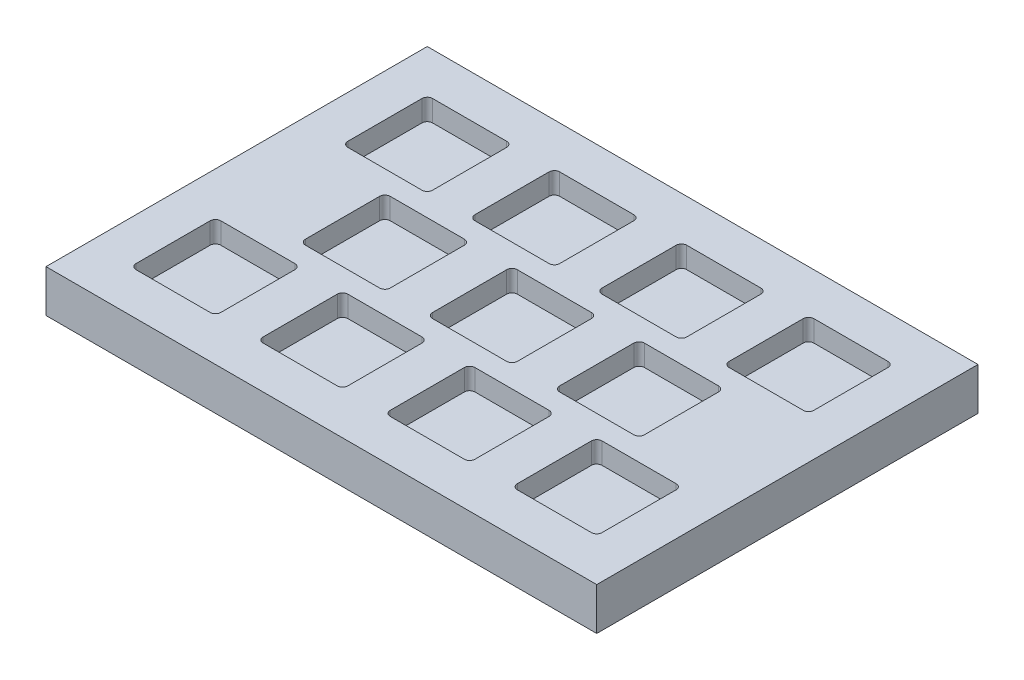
from build123d import *

# Parameters (mm, degrees)
SKETCH1_W              = 165.1
SKETCH1_H              = 114.3
EXTRUDE1_DEPTH         = 12.7
SKETCH2_W              = 25.4
SKETCH2_H              = 25.4
CUT_EXTRUDE1_DEPTH     = 6.35
SKETCH3_W              = 25.4
SKETCH3_H              = 25.4
CUT_EXTRUDE2_DEPTH     = 6.35
FILLET1_R              = 1.5875
LPATTERN1_COUNT        = 4
LPATTERN1_PITCH        = 38.1
LPATTERN1_COUNT_DIR2   = 2
LPATTERN1_PITCH_DIR2   = 63.5
FILLET1_OF_LPATTERN1_R = 1.5875
FILLET2_R              = 1.5875
LPATTERN2_COUNT        = 3
LPATTERN2_PITCH        = 38.1
FILLET2_OF_LPATTERN2_R = 1.5875


with BuildPart() as part:
    # Sketch1 → Extrude1 (new body)
    with BuildSketch(Plane(origin=(0, 0, 0), x_dir=(1, 0, 0), z_dir=(0, 1, 0))):
        Rectangle(SKETCH1_W, SKETCH1_H)
    extrude(amount=EXTRUDE1_DEPTH)

    # Sketch2 → Cut-Extrude1 (cut)
    with BuildSketch(Plane(origin=(0, 12.7, 0), x_dir=(-1, 0, 0), z_dir=(0, 1, 0))):
        with Locations((57.15, -31.75)):
            Rectangle(SKETCH2_W, SKETCH2_H)
    cut_extrude1 = extrude(amount=-CUT_EXTRUDE1_DEPTH, mode=Mode.SUBTRACT)

    # Sketch3 → Cut-Extrude2 (cut)
    with BuildSketch(Plane(origin=(0, 12.7, 0), x_dir=(-1, 0, 0), z_dir=(0, 1, 0))):
        with Locations((38.1, 0)):
            Rectangle(SKETCH3_W, SKETCH3_H)
    cut_extrude2 = extrude(amount=-CUT_EXTRUDE2_DEPTH, mode=Mode.SUBTRACT)

    # Fillet1
    fillet1_edges = [part.edges().sort_by_distance(p)[0] for p in [
        (-44.45, 9.525, -44.45),
        (-44.45, 9.525, -19.05),
        (-69.85, 9.525, -19.05),
        (-69.85, 9.525, -44.45),
    ]]
    fillet(fillet1_edges, radius=FILLET1_R)

    # LPattern1: Cut-Extrude1 4 × 2
    with Locations(*[(i * LPATTERN1_PITCH, 0, j * LPATTERN1_PITCH_DIR2) for i in range(LPATTERN1_COUNT) for j in range(LPATTERN1_COUNT_DIR2) if (i, j) != (0, 0)]):
        add(cut_extrude1, mode=Mode.SUBTRACT)

    # Fillet1 of LPattern1
    fillet1_of_lpattern1_edges = [part.edges().sort_by_distance(p)[0] for p in [
        (-44.45, 9.525, 19.05),
        (-44.45, 9.525, 44.45),
        (-69.85, 9.525, 44.45),
        (-69.85, 9.525, 19.05),
        (-6.35, 9.525, -44.45),
        (-6.35, 9.525, -19.05),
        (-31.75, 9.525, -19.05),
        (-31.75, 9.525, -44.45),
        (-6.35, 9.525, 19.05),
        (-6.35, 9.525, 44.45),
        (-31.75, 9.525, 44.45),
        (-31.75, 9.525, 19.05),
        (31.75, 9.525, -44.45),
        (31.75, 9.525, -19.05),
        (6.35, 9.525, -19.05),
        (6.35, 9.525, -44.45),
        (31.75, 9.525, 19.05),
        (31.75, 9.525, 44.45),
        (6.35, 9.525, 44.45),
        (6.35, 9.525, 19.05),
        (69.85, 9.525, -44.45),
        (69.85, 9.525, -19.05),
        (44.45, 9.525, -19.05),
        (44.45, 9.525, -44.45),
        (69.85, 9.525, 19.05),
        (69.85, 9.525, 44.45),
        (44.45, 9.525, 44.45),
        (44.45, 9.525, 19.05),
    ]]
    fillet(fillet1_of_lpattern1_edges, radius=FILLET1_OF_LPATTERN1_R)

    # Fillet2
    fillet2_edges = [part.edges().sort_by_distance(p)[0] for p in [
        (-25.4, 9.525, -12.7),
        (-25.4, 9.525, 12.7),
        (-50.8, 9.525, 12.7),
        (-50.8, 9.525, -12.7),
    ]]
    fillet(fillet2_edges, radius=FILLET2_R)

    # LPattern2: Cut-Extrude2 ×3
    with Locations(*[(i * LPATTERN2_PITCH, 0, 0) for i in range(1, LPATTERN2_COUNT)]):
        add(cut_extrude2, mode=Mode.SUBTRACT)

    # Fillet2 of LPattern2
    fillet2_of_lpattern2_edges = [part.edges().sort_by_distance(p)[0] for p in [
        (12.7, 9.525, -12.7),
        (12.7, 9.525, 12.7),
        (-12.7, 9.525, 12.7),
        (-12.7, 9.525, -12.7),
        (50.8, 9.525, -12.7),
        (50.8, 9.525, 12.7),
        (25.4, 9.525, 12.7),
        (25.4, 9.525, -12.7),
    ]]
    fillet(fillet2_of_lpattern2_edges, radius=FILLET2_OF_LPATTERN2_R)


solid = part.part
